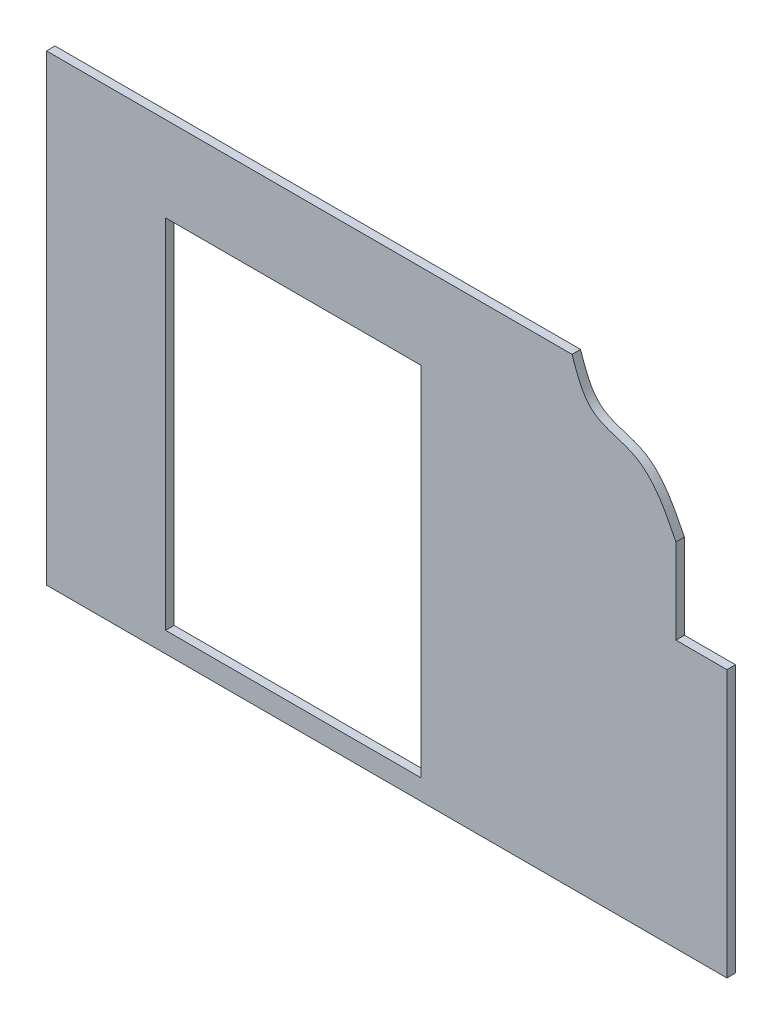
from build123d import *

# Parameters (mm, degrees)
ESQUISSE1_W      = 150
ESQUISSE1_H      = 210
EXTRUSION1_DEPTH = 5


with BuildPart() as part:
    # Esquisse1 → Extrusion1 (new body)
    with BuildSketch(Plane.XY):
        with BuildLine():
            Line((371.489416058, 157), (371.489416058, 0))
            Line((371.489416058, 0), (-28.510583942, 0))
            Line((-28.510583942, 0), (-28.510583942, 272))
            Line((-28.510583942, 272), (280.406919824, 272))
            add(Edge.make_bspline(
                [(341.489416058, 207), (335.021233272, 220.004625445), (324.565439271, 241.026555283), (289.634908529, 245.053974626), (283.552303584, 262.815377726), (280.406919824, 272)],
                knots=[0, 0, 0, 0, 0.439235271, 0.710022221, 1, 1, 1, 1], degree=3))
            Line((341.489416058, 207), (341.489416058, 157))
            Line((341.489416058, 157), (371.489416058, 157))
        make_face()
        with Locations((116.489416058, 117)):
            Rectangle(ESQUISSE1_W, ESQUISSE1_H, mode=Mode.SUBTRACT)
    extrude(amount=EXTRUSION1_DEPTH)


solid = part.part
